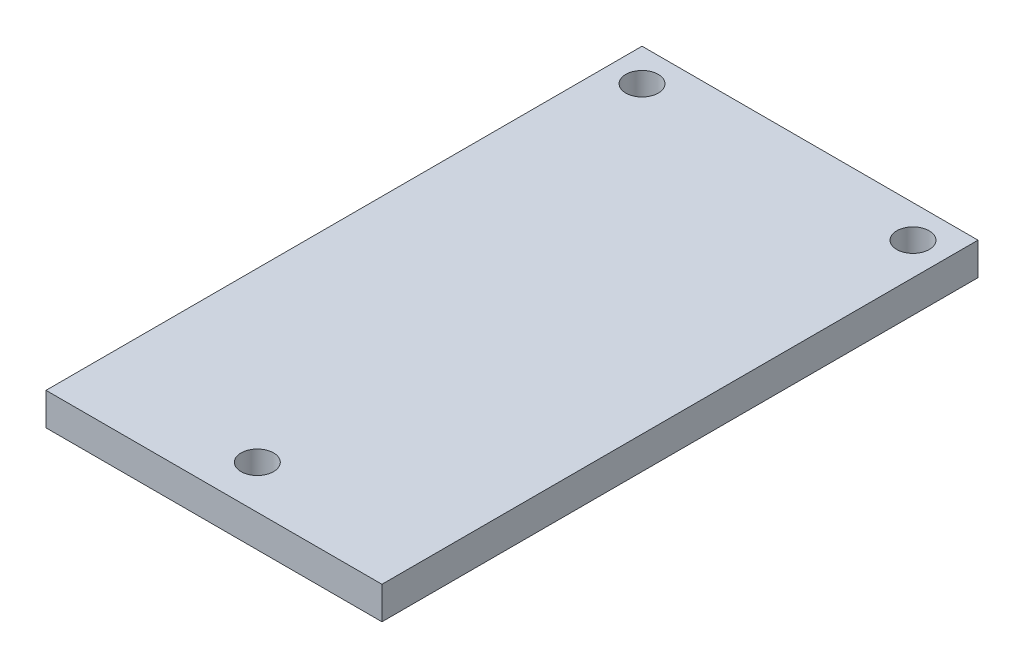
ISO-10303-21;
HEADER;
FILE_DESCRIPTION(('STEP AP214'),'2;1');
FILE_NAME('part.step','',(''),(''),'','','');
FILE_SCHEMA(('AUTOMOTIVE_DESIGN { 1 0 10303 214 1 1 1 1 }'));
ENDSEC;
DATA;
#1=APPLICATION_CONTEXT('core data for automotive mechanical design processes');
#2=APPLICATION_PROTOCOL_DEFINITION('international standard','automotive_design',2000,#1);
#3=PRODUCT_CONTEXT('',#1,'mechanical');
#4=PRODUCT('Part','Part','',(#3));
#5=PRODUCT_RELATED_PRODUCT_CATEGORY('part','',(#4));
#6=PRODUCT_DEFINITION_FORMATION('','',#4);
#7=PRODUCT_DEFINITION_CONTEXT('part definition',#1,'design');
#8=PRODUCT_DEFINITION('design','',#6,#7);
#9=PRODUCT_DEFINITION_SHAPE('','',#8);
#10=(LENGTH_UNIT() NAMED_UNIT(*) SI_UNIT(.MILLI.,.METRE.));
#11=(NAMED_UNIT(*) PLANE_ANGLE_UNIT() SI_UNIT($,.RADIAN.));
#12=(NAMED_UNIT(*) SI_UNIT($,.STERADIAN.) SOLID_ANGLE_UNIT());
#13=UNCERTAINTY_MEASURE_WITH_UNIT(LENGTH_MEASURE(1.E-05),#10,'distance_accuracy_value','');
#14=(GEOMETRIC_REPRESENTATION_CONTEXT(3) GLOBAL_UNCERTAINTY_ASSIGNED_CONTEXT((#13)) GLOBAL_UNIT_ASSIGNED_CONTEXT((#10,
#11,#12)) REPRESENTATION_CONTEXT('',''));
#15=CARTESIAN_POINT('',(0.,0.,0.));
#16=DIRECTION('',(0.,0.,1.));
#17=DIRECTION('',(1.,0.,0.));
#18=AXIS2_PLACEMENT_3D('',#15,#16,#17);
#19=CARTESIAN_POINT('',(0.,6.,-110.));
#20=DIRECTION('',(0.,-1.,0.));
#21=DIRECTION('',(0.,0.,-1.));
#22=AXIS2_PLACEMENT_3D('',#19,#20,#21);
#23=PLANE('',#22);
#24=CARTESIAN_POINT('',(6.,6.,-104.));
#25=DIRECTION('',(0.,1.,0.));
#26=DIRECTION('',(0.,0.,1.));
#27=AXIS2_PLACEMENT_3D('',#24,#25,#26);
#28=CIRCLE('',#27,3.);
#29=CARTESIAN_POINT('',(6.,6.,-101.));
#30=VERTEX_POINT('',#29);
#31=EDGE_CURVE('E125',#30,#30,#28,.T.);
#32=ORIENTED_EDGE('',*,*,#31,.F.);
#33=EDGE_LOOP('',(#32));
#34=FACE_BOUND('',#33,.T.);
#35=DIRECTION('',(0.,0.,1.));
#36=VECTOR('',#35,1.);
#37=CARTESIAN_POINT('',(0.,6.,0.));
#38=LINE('',#37,#36);
#39=CARTESIAN_POINT('',(0.,6.,-110.));
#40=VERTEX_POINT('',#39);
#41=CARTESIAN_POINT('',(0.,6.,0.));
#42=VERTEX_POINT('',#41);
#43=EDGE_CURVE('E99',#40,#42,#38,.T.);
#44=ORIENTED_EDGE('',*,*,#43,.T.);
#45=DIRECTION('',(1.,0.,0.));
#46=VECTOR('',#45,1.);
#47=CARTESIAN_POINT('',(0.,6.,0.));
#48=LINE('',#47,#46);
#49=CARTESIAN_POINT('',(62.,6.,0.));
#50=VERTEX_POINT('',#49);
#51=EDGE_CURVE('E84',#42,#50,#48,.T.);
#52=ORIENTED_EDGE('',*,*,#51,.T.);
#53=DIRECTION('',(0.,0.,-1.));
#54=VECTOR('',#53,1.);
#55=CARTESIAN_POINT('',(62.,6.,0.));
#56=LINE('',#55,#54);
#57=CARTESIAN_POINT('',(62.,6.,-110.));
#58=VERTEX_POINT('',#57);
#59=EDGE_CURVE('E50',#50,#58,#56,.T.);
#60=ORIENTED_EDGE('',*,*,#59,.T.);
#61=DIRECTION('',(-1.,0.,0.));
#62=VECTOR('',#61,1.);
#63=CARTESIAN_POINT('',(0.,6.,-110.));
#64=LINE('',#63,#62);
#65=EDGE_CURVE('E45',#58,#40,#64,.T.);
#66=ORIENTED_EDGE('',*,*,#65,.T.);
#67=EDGE_LOOP('',(#44,#52,#60,#66));
#68=FACE_BOUND('',#67,.T.);
#69=CARTESIAN_POINT('',(31.,6.,-8.));
#70=DIRECTION('',(0.,1.,0.));
#71=DIRECTION('',(0.,0.,1.));
#72=AXIS2_PLACEMENT_3D('',#69,#70,#71);
#73=CIRCLE('',#72,3.);
#74=CARTESIAN_POINT('',(31.,6.,-5.));
#75=VERTEX_POINT('',#74);
#76=EDGE_CURVE('E89',#75,#75,#73,.T.);
#77=ORIENTED_EDGE('',*,*,#76,.F.);
#78=EDGE_LOOP('',(#77));
#79=FACE_BOUND('',#78,.T.);
#80=CARTESIAN_POINT('',(56.,6.,-104.));
#81=DIRECTION('',(0.,1.,0.));
#82=DIRECTION('',(0.,0.,1.));
#83=AXIS2_PLACEMENT_3D('',#80,#81,#82);
#84=CIRCLE('',#83,3.);
#85=CARTESIAN_POINT('',(56.,6.,-101.));
#86=VERTEX_POINT('',#85);
#87=EDGE_CURVE('E119',#86,#86,#84,.T.);
#88=ORIENTED_EDGE('',*,*,#87,.F.);
#89=EDGE_LOOP('',(#88));
#90=FACE_BOUND('',#89,.T.);
#91=ADVANCED_FACE('F30',(#34,#68,#79,#90),#23,.F.);
#92=CARTESIAN_POINT('',(0.,0.,-110.));
#93=DIRECTION('',(0.,-1.,0.));
#94=DIRECTION('',(0.,0.,-1.));
#95=AXIS2_PLACEMENT_3D('',#92,#93,#94);
#96=PLANE('',#95);
#97=CARTESIAN_POINT('',(6.,0.,-104.));
#98=DIRECTION('',(0.,1.,0.));
#99=DIRECTION('',(0.,0.,1.));
#100=AXIS2_PLACEMENT_3D('',#97,#98,#99);
#101=CIRCLE('',#100,3.);
#102=CARTESIAN_POINT('',(6.,0.,-101.));
#103=VERTEX_POINT('',#102);
#104=EDGE_CURVE('E121',#103,#103,#101,.T.);
#105=ORIENTED_EDGE('',*,*,#104,.T.);
#106=EDGE_LOOP('',(#105));
#107=FACE_BOUND('',#106,.T.);
#108=DIRECTION('',(0.,0.,1.));
#109=VECTOR('',#108,1.);
#110=CARTESIAN_POINT('',(0.,0.,0.));
#111=LINE('',#110,#109);
#112=CARTESIAN_POINT('',(0.,0.,-110.));
#113=VERTEX_POINT('',#112);
#114=CARTESIAN_POINT('',(0.,0.,0.));
#115=VERTEX_POINT('',#114);
#116=EDGE_CURVE('E76',#113,#115,#111,.T.);
#117=ORIENTED_EDGE('',*,*,#116,.F.);
#118=DIRECTION('',(-1.,0.,0.));
#119=VECTOR('',#118,1.);
#120=CARTESIAN_POINT('',(0.,0.,-110.));
#121=LINE('',#120,#119);
#122=CARTESIAN_POINT('',(62.,0.,-110.));
#123=VERTEX_POINT('',#122);
#124=EDGE_CURVE('E97',#123,#113,#121,.T.);
#125=ORIENTED_EDGE('',*,*,#124,.F.);
#126=DIRECTION('',(0.,0.,-1.));
#127=VECTOR('',#126,1.);
#128=CARTESIAN_POINT('',(62.,0.,0.));
#129=LINE('',#128,#127);
#130=CARTESIAN_POINT('',(62.,0.,0.));
#131=VERTEX_POINT('',#130);
#132=EDGE_CURVE('E77',#131,#123,#129,.T.);
#133=ORIENTED_EDGE('',*,*,#132,.F.);
#134=DIRECTION('',(1.,0.,0.));
#135=VECTOR('',#134,1.);
#136=CARTESIAN_POINT('',(0.,0.,0.));
#137=LINE('',#136,#135);
#138=EDGE_CURVE('E71',#115,#131,#137,.T.);
#139=ORIENTED_EDGE('',*,*,#138,.F.);
#140=EDGE_LOOP('',(#117,#125,#133,#139));
#141=FACE_BOUND('',#140,.T.);
#142=CARTESIAN_POINT('',(31.,0.,-8.));
#143=DIRECTION('',(0.,1.,0.));
#144=DIRECTION('',(0.,0.,1.));
#145=AXIS2_PLACEMENT_3D('',#142,#143,#144);
#146=CIRCLE('',#145,3.);
#147=CARTESIAN_POINT('',(31.,0.,-5.));
#148=VERTEX_POINT('',#147);
#149=EDGE_CURVE('E92',#148,#148,#146,.T.);
#150=ORIENTED_EDGE('',*,*,#149,.T.);
#151=EDGE_LOOP('',(#150));
#152=FACE_BOUND('',#151,.T.);
#153=CARTESIAN_POINT('',(56.,0.,-104.));
#154=DIRECTION('',(0.,1.,0.));
#155=DIRECTION('',(0.,0.,1.));
#156=AXIS2_PLACEMENT_3D('',#153,#154,#155);
#157=CIRCLE('',#156,3.);
#158=CARTESIAN_POINT('',(56.,0.,-101.));
#159=VERTEX_POINT('',#158);
#160=EDGE_CURVE('E122',#159,#159,#157,.T.);
#161=ORIENTED_EDGE('',*,*,#160,.T.);
#162=EDGE_LOOP('',(#161));
#163=FACE_BOUND('',#162,.T.);
#164=ADVANCED_FACE('F72',(#107,#141,#152,#163),#96,.T.);
#165=CARTESIAN_POINT('',(0.,6.,0.));
#166=DIRECTION('',(1.,0.,0.));
#167=DIRECTION('',(0.,0.,-1.));
#168=AXIS2_PLACEMENT_3D('',#165,#166,#167);
#169=PLANE('',#168);
#170=ORIENTED_EDGE('',*,*,#116,.T.);
#171=DIRECTION('',(0.,-1.,0.));
#172=VECTOR('',#171,1.);
#173=CARTESIAN_POINT('',(0.,6.,0.));
#174=LINE('',#173,#172);
#175=EDGE_CURVE('E11',#42,#115,#174,.T.);
#176=ORIENTED_EDGE('',*,*,#175,.F.);
#177=ORIENTED_EDGE('',*,*,#43,.F.);
#178=DIRECTION('',(0.,-1.,0.));
#179=VECTOR('',#178,1.);
#180=CARTESIAN_POINT('',(0.,6.,-110.));
#181=LINE('',#180,#179);
#182=EDGE_CURVE('E88',#40,#113,#181,.T.);
#183=ORIENTED_EDGE('',*,*,#182,.T.);
#184=EDGE_LOOP('',(#170,#176,#177,#183));
#185=FACE_BOUND('',#184,.T.);
#186=ADVANCED_FACE('F32',(#185),#169,.F.);
#187=CARTESIAN_POINT('',(0.,6.,0.));
#188=DIRECTION('',(0.,0.,-1.));
#189=DIRECTION('',(-1.,0.,0.));
#190=AXIS2_PLACEMENT_3D('',#187,#188,#189);
#191=PLANE('',#190);
#192=ORIENTED_EDGE('',*,*,#138,.T.);
#193=DIRECTION('',(0.,-1.,0.));
#194=VECTOR('',#193,1.);
#195=CARTESIAN_POINT('',(62.,6.,0.));
#196=LINE('',#195,#194);
#197=EDGE_CURVE('E38',#50,#131,#196,.T.);
#198=ORIENTED_EDGE('',*,*,#197,.F.);
#199=ORIENTED_EDGE('',*,*,#51,.F.);
#200=ORIENTED_EDGE('',*,*,#175,.T.);
#201=EDGE_LOOP('',(#192,#198,#199,#200));
#202=FACE_BOUND('',#201,.T.);
#203=ADVANCED_FACE('F83',(#202),#191,.F.);
#204=CARTESIAN_POINT('',(62.,6.,0.));
#205=DIRECTION('',(-1.,0.,0.));
#206=DIRECTION('',(0.,0.,1.));
#207=AXIS2_PLACEMENT_3D('',#204,#205,#206);
#208=PLANE('',#207);
#209=ORIENTED_EDGE('',*,*,#132,.T.);
#210=DIRECTION('',(0.,-1.,0.));
#211=VECTOR('',#210,1.);
#212=CARTESIAN_POINT('',(62.,6.,-110.));
#213=LINE('',#212,#211);
#214=EDGE_CURVE('E105',#58,#123,#213,.T.);
#215=ORIENTED_EDGE('',*,*,#214,.F.);
#216=ORIENTED_EDGE('',*,*,#59,.F.);
#217=ORIENTED_EDGE('',*,*,#197,.T.);
#218=EDGE_LOOP('',(#209,#215,#216,#217));
#219=FACE_BOUND('',#218,.T.);
#220=ADVANCED_FACE('F108',(#219),#208,.F.);
#221=CARTESIAN_POINT('',(0.,6.,-110.));
#222=DIRECTION('',(0.,0.,1.));
#223=DIRECTION('',(1.,0.,0.));
#224=AXIS2_PLACEMENT_3D('',#221,#222,#223);
#225=PLANE('',#224);
#226=ORIENTED_EDGE('',*,*,#124,.T.);
#227=ORIENTED_EDGE('',*,*,#182,.F.);
#228=ORIENTED_EDGE('',*,*,#65,.F.);
#229=ORIENTED_EDGE('',*,*,#214,.T.);
#230=EDGE_LOOP('',(#226,#227,#228,#229));
#231=FACE_BOUND('',#230,.T.);
#232=ADVANCED_FACE('F110',(#231),#225,.F.);
#233=CARTESIAN_POINT('',(31.,6.,-8.));
#234=DIRECTION('',(0.,-1.,0.));
#235=DIRECTION('',(0.,0.,-1.));
#236=AXIS2_PLACEMENT_3D('',#233,#234,#235);
#237=CYLINDRICAL_SURFACE('',#236,3.);
#238=ORIENTED_EDGE('',*,*,#76,.T.);
#239=EDGE_LOOP('',(#238));
#240=FACE_BOUND('',#239,.T.);
#241=ORIENTED_EDGE('',*,*,#149,.F.);
#242=EDGE_LOOP('',(#241));
#243=FACE_BOUND('',#242,.T.);
#244=ADVANCED_FACE('F135',(#240,#243),#237,.F.);
#245=CARTESIAN_POINT('',(6.,6.,-104.));
#246=DIRECTION('',(0.,-1.,0.));
#247=DIRECTION('',(0.,0.,-1.));
#248=AXIS2_PLACEMENT_3D('',#245,#246,#247);
#249=CYLINDRICAL_SURFACE('',#248,3.);
#250=ORIENTED_EDGE('',*,*,#31,.T.);
#251=EDGE_LOOP('',(#250));
#252=FACE_BOUND('',#251,.T.);
#253=ORIENTED_EDGE('',*,*,#104,.F.);
#254=EDGE_LOOP('',(#253));
#255=FACE_BOUND('',#254,.T.);
#256=ADVANCED_FACE('F137',(#252,#255),#249,.F.);
#257=CARTESIAN_POINT('',(56.,6.,-104.));
#258=DIRECTION('',(0.,-1.,0.));
#259=DIRECTION('',(0.,0.,-1.));
#260=AXIS2_PLACEMENT_3D('',#257,#258,#259);
#261=CYLINDRICAL_SURFACE('',#260,3.);
#262=ORIENTED_EDGE('',*,*,#87,.T.);
#263=EDGE_LOOP('',(#262));
#264=FACE_BOUND('',#263,.T.);
#265=ORIENTED_EDGE('',*,*,#160,.F.);
#266=EDGE_LOOP('',(#265));
#267=FACE_BOUND('',#266,.T.);
#268=ADVANCED_FACE('F144',(#264,#267),#261,.F.);
#269=CLOSED_SHELL('',(#91,#164,#186,#203,#220,#232,#244,#256,#268));
#270=MANIFOLD_SOLID_BREP('B2',#269);
#271=ADVANCED_BREP_SHAPE_REPRESENTATION('',(#18,#270),#14);
#272=SHAPE_DEFINITION_REPRESENTATION(#9,#271);
ENDSEC;
END-ISO-10303-21;
